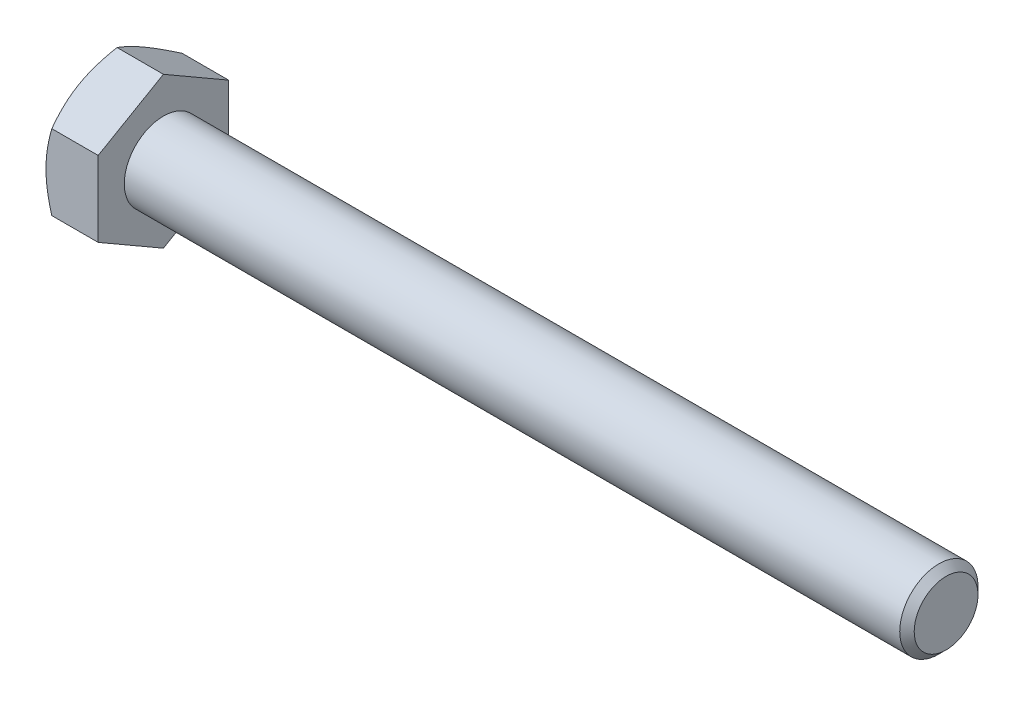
ISO-10303-21;
HEADER;
FILE_DESCRIPTION(('STEP AP214'),'2;1');
FILE_NAME('part.step','',(''),(''),'','','');
FILE_SCHEMA(('AUTOMOTIVE_DESIGN { 1 0 10303 214 1 1 1 1 }'));
ENDSEC;
DATA;
#1=APPLICATION_CONTEXT('core data for automotive mechanical design processes');
#2=APPLICATION_PROTOCOL_DEFINITION('international standard','automotive_design',2000,#1);
#3=PRODUCT_CONTEXT('',#1,'mechanical');
#4=PRODUCT('Part','Part','',(#3));
#5=PRODUCT_RELATED_PRODUCT_CATEGORY('part','',(#4));
#6=PRODUCT_DEFINITION_FORMATION('','',#4);
#7=PRODUCT_DEFINITION_CONTEXT('part definition',#1,'design');
#8=PRODUCT_DEFINITION('design','',#6,#7);
#9=PRODUCT_DEFINITION_SHAPE('','',#8);
#10=(LENGTH_UNIT() NAMED_UNIT(*) SI_UNIT(.MILLI.,.METRE.));
#11=(NAMED_UNIT(*) PLANE_ANGLE_UNIT() SI_UNIT($,.RADIAN.));
#12=(NAMED_UNIT(*) SI_UNIT($,.STERADIAN.) SOLID_ANGLE_UNIT());
#13=UNCERTAINTY_MEASURE_WITH_UNIT(LENGTH_MEASURE(1.E-05),#10,'distance_accuracy_value','');
#14=(GEOMETRIC_REPRESENTATION_CONTEXT(3) GLOBAL_UNCERTAINTY_ASSIGNED_CONTEXT((#13)) GLOBAL_UNIT_ASSIGNED_CONTEXT((#10,
#11,#12)) REPRESENTATION_CONTEXT('',''));
#15=CARTESIAN_POINT('',(0.,0.,0.));
#16=DIRECTION('',(0.,0.,1.));
#17=DIRECTION('',(1.,0.,0.));
#18=AXIS2_PLACEMENT_3D('',#15,#16,#17);
#19=CARTESIAN_POINT('',(4.,2.88675134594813,-5.));
#20=DIRECTION('',(0.,-0.866025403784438,0.500000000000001));
#21=DIRECTION('',(0.,-0.500000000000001,-0.866025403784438));
#22=AXIS2_PLACEMENT_3D('',#19,#20,#21);
#23=PLANE('',#22);
#24=CARTESIAN_POINT('',(0.446648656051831,5.7736181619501,0.0002));
#25=CARTESIAN_POINT('',(0.373386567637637,5.64675433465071,-0.219534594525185));
#26=CARTESIAN_POINT('',(0.306751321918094,5.5188054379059,-0.441148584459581));
#27=CARTESIAN_POINT('',(0.190438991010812,5.26069210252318,-0.888213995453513));
#28=CARTESIAN_POINT('',(0.14080304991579,5.13052307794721,-1.11367335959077));
#29=CARTESIAN_POINT('',(0.0635510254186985,4.87177839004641,-1.56183230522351));
#30=CARTESIAN_POINT('',(0.0354203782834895,4.74324302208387,-1.78446209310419));
#31=CARTESIAN_POINT('',(0.0101949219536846,4.54998783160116,-2.11918990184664));
#32=CARTESIAN_POINT('',(0.00461345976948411,4.48552534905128,-2.23084219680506));
#33=CARTESIAN_POINT('',(-0.000797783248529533,4.35654081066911,-2.4542499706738));
#34=CARTESIAN_POINT('',(-0.000627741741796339,4.2920187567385,-2.56600544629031));
#35=CARTESIAN_POINT('',(0.00775363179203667,4.11524635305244,-2.87218423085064));
#36=CARTESIAN_POINT('',(0.0218297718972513,4.00305457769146,-3.06650608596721));
#37=CARTESIAN_POINT('',(0.06646525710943,3.77941563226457,-3.45386010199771));
#38=CARTESIAN_POINT('',(0.0970398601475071,3.66796924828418,-3.64689090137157));
#39=CARTESIAN_POINT('',(0.173468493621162,3.44387972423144,-4.03502534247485));
#40=CARTESIAN_POINT('',(0.219646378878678,3.3312648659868,-4.23007999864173));
#41=CARTESIAN_POINT('',(0.324451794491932,3.1077146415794,-4.61728034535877));
#42=CARTESIAN_POINT('',(0.383054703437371,2.99677641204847,-4.80943099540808));
#43=CARTESIAN_POINT('',(0.446648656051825,2.88663587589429,-5.0002));
#44=B_SPLINE_CURVE_WITH_KNOTS('',3,(#24,#25,#26,#27,#28,#29,#30,#31,#32,#33,#34,#35,#36,#37,#38,
#39,#40,#41,#42,#43),.UNSPECIFIED.,.F.,.F.,(4,2,2,2,2,2,2,2,2,4),(0.,0.792555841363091,
1.58701660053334,2.36181537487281,2.74884076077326,3.13585419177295,3.80962362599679,
4.48401723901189,5.17336882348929,5.86136694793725),.UNSPECIFIED.);
#45=CARTESIAN_POINT('',(0.446581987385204,5.77350269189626,0.));
#46=VERTEX_POINT('',#45);
#47=CARTESIAN_POINT('',(0.,4.33012701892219,-2.50000000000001));
#48=VERTEX_POINT('',#47);
#49=EDGE_CURVE('E50',#46,#48,#44,.T.);
#50=ORIENTED_EDGE('',*,*,#49,.F.);
#51=DIRECTION('',(-1.,0.,0.));
#52=VECTOR('',#51,1.);
#53=CARTESIAN_POINT('',(4.,5.77350269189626,0.));
#54=LINE('',#53,#52);
#55=CARTESIAN_POINT('',(4.,5.77350269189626,0.));
#56=VERTEX_POINT('',#55);
#57=EDGE_CURVE('E146',#56,#46,#54,.T.);
#58=ORIENTED_EDGE('',*,*,#57,.F.);
#59=DIRECTION('',(0.,0.500000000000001,0.866025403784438));
#60=VECTOR('',#59,1.);
#61=CARTESIAN_POINT('',(4.,2.88675134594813,-5.));
#62=LINE('',#61,#60);
#63=CARTESIAN_POINT('',(4.,2.88675134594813,-5.));
#64=VERTEX_POINT('',#63);
#65=EDGE_CURVE('E237',#64,#56,#62,.T.);
#66=ORIENTED_EDGE('',*,*,#65,.F.);
#67=DIRECTION('',(-1.,0.,0.));
#68=VECTOR('',#67,1.);
#69=CARTESIAN_POINT('',(4.,2.88675134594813,-5.));
#70=LINE('',#69,#68);
#71=CARTESIAN_POINT('',(0.446581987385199,2.88675134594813,-5.));
#72=VERTEX_POINT('',#71);
#73=EDGE_CURVE('E134',#64,#72,#70,.T.);
#74=ORIENTED_EDGE('',*,*,#73,.T.);
#75=EDGE_CURVE('E128',#48,#72,#44,.T.);
#76=ORIENTED_EDGE('',*,*,#75,.F.);
#77=EDGE_LOOP('',(#50,#58,#66,#74,#76));
#78=FACE_BOUND('',#77,.T.);
#79=ADVANCED_FACE('F34',(#78),#23,.F.);
#80=CARTESIAN_POINT('',(4.,5.77350269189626,0.));
#81=DIRECTION('',(0.,-0.866025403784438,-0.500000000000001));
#82=DIRECTION('',(0.,0.500000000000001,-0.866025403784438));
#83=AXIS2_PLACEMENT_3D('',#80,#81,#82);
#84=PLANE('',#83);
#85=CARTESIAN_POINT('',(0.446648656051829,2.88663587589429,5.0002));
#86=CARTESIAN_POINT('',(0.373386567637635,3.01349970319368,4.78046540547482));
#87=CARTESIAN_POINT('',(0.306751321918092,3.14144859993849,4.55885141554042));
#88=CARTESIAN_POINT('',(0.190438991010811,3.39956193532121,4.11178600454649));
#89=CARTESIAN_POINT('',(0.140803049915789,3.52973095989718,3.88632664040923));
#90=CARTESIAN_POINT('',(0.0635510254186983,3.78847564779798,3.43816769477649));
#91=CARTESIAN_POINT('',(0.0354203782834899,3.91701101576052,3.21553790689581));
#92=CARTESIAN_POINT('',(0.0101949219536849,4.11026620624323,2.88081009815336));
#93=CARTESIAN_POINT('',(0.00461345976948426,4.17472868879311,2.76915780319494));
#94=CARTESIAN_POINT('',(-0.000797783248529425,4.30371322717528,2.5457500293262));
#95=CARTESIAN_POINT('',(-0.000627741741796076,4.36823528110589,2.43399455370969));
#96=CARTESIAN_POINT('',(0.0077536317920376,4.54500768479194,2.12781576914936));
#97=CARTESIAN_POINT('',(0.021829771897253,4.65719946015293,1.93349391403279));
#98=CARTESIAN_POINT('',(0.0664652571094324,4.88083840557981,1.5461398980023));
#99=CARTESIAN_POINT('',(0.0970398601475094,4.99228478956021,1.35310909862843));
#100=CARTESIAN_POINT('',(0.173468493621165,5.21637431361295,0.964974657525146));
#101=CARTESIAN_POINT('',(0.219646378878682,5.32898917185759,0.769920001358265));
#102=CARTESIAN_POINT('',(0.324451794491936,5.55253939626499,0.382719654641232));
#103=CARTESIAN_POINT('',(0.383054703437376,5.66347762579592,0.190569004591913));
#104=CARTESIAN_POINT('',(0.446648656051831,5.7736181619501,-0.000200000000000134));
#105=B_SPLINE_CURVE_WITH_KNOTS('',3,(#85,#86,#87,#88,#89,#90,#91,#92,#93,#94,#95,#96,#97,#98,
#99,#100,#101,#102,#103,#104),.UNSPECIFIED.,.F.,.F.,(4,2,2,2,2,2,2,2,2,4),(0.,0.792555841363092,
1.58701660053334,2.36181537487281,2.74884076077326,3.13585419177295,3.80962362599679,
4.4840172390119,5.17336882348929,5.86136694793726),.UNSPECIFIED.);
#106=CARTESIAN_POINT('',(0.446581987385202,2.88675134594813,5.));
#107=VERTEX_POINT('',#106);
#108=CARTESIAN_POINT('',(0.,4.33012701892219,2.5));
#109=VERTEX_POINT('',#108);
#110=EDGE_CURVE('E57',#107,#109,#105,.T.);
#111=ORIENTED_EDGE('',*,*,#110,.F.);
#112=DIRECTION('',(-1.,0.,0.));
#113=VECTOR('',#112,1.);
#114=CARTESIAN_POINT('',(4.,2.88675134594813,5.));
#115=LINE('',#114,#113);
#116=CARTESIAN_POINT('',(4.,2.88675134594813,5.));
#117=VERTEX_POINT('',#116);
#118=EDGE_CURVE('E144',#117,#107,#115,.T.);
#119=ORIENTED_EDGE('',*,*,#118,.F.);
#120=DIRECTION('',(0.,-0.500000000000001,0.866025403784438));
#121=VECTOR('',#120,1.);
#122=CARTESIAN_POINT('',(4.,5.77350269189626,0.));
#123=LINE('',#122,#121);
#124=EDGE_CURVE('E235',#56,#117,#123,.T.);
#125=ORIENTED_EDGE('',*,*,#124,.F.);
#126=ORIENTED_EDGE('',*,*,#57,.T.);
#127=EDGE_CURVE('E161',#109,#46,#105,.T.);
#128=ORIENTED_EDGE('',*,*,#127,.F.);
#129=EDGE_LOOP('',(#111,#119,#125,#126,#128));
#130=FACE_BOUND('',#129,.T.);
#131=ADVANCED_FACE('F167',(#130),#84,.F.);
#132=CARTESIAN_POINT('',(4.,2.88675134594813,5.));
#133=DIRECTION('',(0.,0.,-1.));
#134=DIRECTION('',(-1.,0.,0.));
#135=AXIS2_PLACEMENT_3D('',#132,#133,#134);
#136=PLANE('',#135);
#137=CARTESIAN_POINT('',(2.47533544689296,-7.82661640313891,5.));
#138=CARTESIAN_POINT('',(2.36879683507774,-7.60758613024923,5.));
#139=CARTESIAN_POINT('',(2.26325911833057,-7.38806071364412,5.));
#140=CARTESIAN_POINT('',(2.05474707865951,-6.94775649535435,5.));
#141=CARTESIAN_POINT('',(1.95177314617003,-6.7269775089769,5.));
#142=CARTESIAN_POINT('',(1.74844778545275,-6.28280027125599,5.));
#143=CARTESIAN_POINT('',(1.64811306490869,-6.05939434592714,5.));
#144=CARTESIAN_POINT('',(1.45145486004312,-5.61083043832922,5.));
#145=CARTESIAN_POINT('',(1.35513119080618,-5.38567253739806,5.));
#146=CARTESIAN_POINT('',(1.16445037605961,-4.92576614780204,5.));
#147=CARTESIAN_POINT('',(1.07026351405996,-4.69094667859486,5.));
#148=CARTESIAN_POINT('',(0.888844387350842,-4.21858752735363,5.));
#149=CARTESIAN_POINT('',(0.801612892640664,-3.98104754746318,5.));
#150=CARTESIAN_POINT('',(0.636341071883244,-3.50329086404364,5.));
#151=CARTESIAN_POINT('',(0.558282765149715,-3.26308044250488,5.));
#152=CARTESIAN_POINT('',(0.413813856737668,-2.77921467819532,5.));
#153=CARTESIAN_POINT('',(0.347399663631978,-2.53556042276,5.));
#154=CARTESIAN_POINT('',(0.229707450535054,-2.04600448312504,5.));
#155=CARTESIAN_POINT('',(0.178346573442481,-1.80012308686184,5.));
#156=CARTESIAN_POINT('',(0.0936230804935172,-1.30522837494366,5.));
#157=CARTESIAN_POINT('',(0.0602585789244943,-1.05621539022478,5.));
#158=CARTESIAN_POINT('',(0.0146229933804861,-0.559584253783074,5.));
#159=CARTESIAN_POINT('',(0.00207498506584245,-0.311992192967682,5.));
#160=CARTESIAN_POINT('',(-0.00159747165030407,0.183375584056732,5.));
#161=CARTESIAN_POINT('',(0.00727849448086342,0.431151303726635,5.));
#162=CARTESIAN_POINT('',(0.039726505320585,0.849622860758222,5.));
#163=CARTESIAN_POINT('',(0.0579847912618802,1.02075746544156,5.));
#164=CARTESIAN_POINT('',(0.103624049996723,1.36181398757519,5.));
#165=CARTESIAN_POINT('',(0.131006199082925,1.5317357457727,5.));
#166=CARTESIAN_POINT('',(0.225403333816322,2.03942834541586,5.));
#167=CARTESIAN_POINT('',(0.304653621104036,2.37495177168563,5.));
#168=CARTESIAN_POINT('',(0.442611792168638,2.87686006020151,5.));
#169=CARTESIAN_POINT('',(0.492453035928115,3.04583048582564,5.));
#170=CARTESIAN_POINT('',(0.597441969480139,3.38213061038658,5.));
#171=CARTESIAN_POINT('',(0.652589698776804,3.54946029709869,5.));
#172=CARTESIAN_POINT('',(0.767295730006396,3.88253122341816,5.));
#173=CARTESIAN_POINT('',(0.826852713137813,4.04827292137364,5.));
#174=CARTESIAN_POINT('',(0.94966349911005,4.37837269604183,5.));
#175=CARTESIAN_POINT('',(1.01291722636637,4.54273080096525,5.));
#176=CARTESIAN_POINT('',(1.18384085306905,4.97467594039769,5.));
#177=CARTESIAN_POINT('',(1.29410564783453,5.24123504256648,5.));
#178=CARTESIAN_POINT('',(1.52085041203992,5.77170603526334,5.));
#179=CARTESIAN_POINT('',(1.63733099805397,6.03561766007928,5.));
#180=CARTESIAN_POINT('',(1.87507624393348,6.56138078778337,5.));
#181=CARTESIAN_POINT('',(1.99634255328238,6.82323154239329,5.));
#182=CARTESIAN_POINT('',(2.24254703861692,7.34518395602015,5.));
#183=CARTESIAN_POINT('',(2.36748508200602,7.60528567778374,5.));
#184=CARTESIAN_POINT('',(2.62044102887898,8.12446478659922,5.));
#185=CARTESIAN_POINT('',(2.74846325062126,8.38354006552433,5.));
#186=CARTESIAN_POINT('',(3.00682668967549,8.90053291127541,5.));
#187=CARTESIAN_POINT('',(3.13716793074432,9.1584504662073,5.));
#188=CARTESIAN_POINT('',(3.53092424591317,9.9306766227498,5.));
#189=CARTESIAN_POINT('',(3.79712405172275,10.4435647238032,5.));
#190=CARTESIAN_POINT('',(4.30724046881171,11.4147548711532,5.));
#191=CARTESIAN_POINT('',(4.55067498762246,11.873311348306,5.));
#192=CARTESIAN_POINT('',(5.04052915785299,12.7888590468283,5.));
#193=CARTESIAN_POINT('',(5.28694897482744,13.2458501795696,5.));
#194=CARTESIAN_POINT('',(5.78122505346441,14.1571829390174,5.));
#195=CARTESIAN_POINT('',(6.02907430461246,14.6115283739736,5.));
#196=CARTESIAN_POINT('',(6.52648185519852,15.5192398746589,5.));
#197=CARTESIAN_POINT('',(6.77604002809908,15.9726060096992,5.));
#198=CARTESIAN_POINT('',(7.02622264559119,16.4256251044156,5.));
#199=B_SPLINE_CURVE_WITH_KNOTS('',3,(#137,#138,#139,#140,#141,#142,#143,#144,#145,#146,#147,
#148,#149,#150,#151,#152,#153,#154,#155,#156,#157,#158,#159,#160,#161,#162,#163,#164,#165,#166,
#167,#168,#169,#170,#171,#172,#173,#174,#175,#176,#177,#178,#179,#180,#181,#182,#183,#184,#185,
#186,#187,#188,#189,#190,#191,#192,#193,#194,#195,#196,#197,#198),.UNSPECIFIED.,.F.,.F.,(4,2,2,
2,2,2,2,2,2,2,2,2,2,2,2,2,2,2,2,2,2,2,2,2,2,2,2,2,2,2,4),(0.,0.7307086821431,1.46152797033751,
2.19620403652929,2.93084619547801,3.68977491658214,4.44878753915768,5.20628666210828,
5.96355173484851,6.71656679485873,7.46950293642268,8.21233991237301,8.95519126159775,
9.4712599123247,9.98739512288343,11.0201893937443,11.5486465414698,12.0771076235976,
12.6054112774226,13.1337041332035,13.9989833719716,14.8643486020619,15.7300147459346,
16.5956496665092,17.4625765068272,18.3295122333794,20.0630293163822,21.6205191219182,
23.1780956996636,24.7307447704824,26.2832800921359),.UNSPECIFIED.);
#200=CARTESIAN_POINT('',(0.446581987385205,-2.88675134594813,5.));
#201=VERTEX_POINT('',#200);
#202=CARTESIAN_POINT('',(0.,0.,5.));
#203=VERTEX_POINT('',#202);
#204=EDGE_CURVE('E247',#201,#203,#199,.T.);
#205=ORIENTED_EDGE('',*,*,#204,.F.);
#206=DIRECTION('',(-1.,0.,0.));
#207=VECTOR('',#206,1.);
#208=CARTESIAN_POINT('',(4.,-2.88675134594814,5.));
#209=LINE('',#208,#207);
#210=CARTESIAN_POINT('',(4.,-2.88675134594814,5.));
#211=VERTEX_POINT('',#210);
#212=EDGE_CURVE('E136',#211,#201,#209,.T.);
#213=ORIENTED_EDGE('',*,*,#212,.F.);
#214=DIRECTION('',(0.,-1.,0.));
#215=VECTOR('',#214,1.);
#216=CARTESIAN_POINT('',(4.,2.88675134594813,5.));
#217=LINE('',#216,#215);
#218=EDGE_CURVE('E231',#117,#211,#217,.T.);
#219=ORIENTED_EDGE('',*,*,#218,.F.);
#220=ORIENTED_EDGE('',*,*,#118,.T.);
#221=EDGE_CURVE('E185',#203,#107,#199,.T.);
#222=ORIENTED_EDGE('',*,*,#221,.F.);
#223=EDGE_LOOP('',(#205,#213,#219,#220,#222));
#224=FACE_BOUND('',#223,.T.);
#225=ADVANCED_FACE('F253',(#224),#136,.F.);
#226=CARTESIAN_POINT('',(4.,-5.77350269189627,0.));
#227=DIRECTION('',(0.,0.866025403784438,-0.500000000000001));
#228=DIRECTION('',(0.,0.500000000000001,0.866025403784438));
#229=AXIS2_PLACEMENT_3D('',#226,#227,#228);
#230=PLANE('',#229);
#231=CARTESIAN_POINT('',(0.446648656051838,-5.77361816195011,-0.000199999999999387));
#232=CARTESIAN_POINT('',(0.373386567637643,-5.64675433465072,0.219534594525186));
#233=CARTESIAN_POINT('',(0.3067513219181,-5.51880543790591,0.441148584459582));
#234=CARTESIAN_POINT('',(0.190438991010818,-5.26069210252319,0.888213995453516));
#235=CARTESIAN_POINT('',(0.140803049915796,-5.13052307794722,1.11367335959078));
#236=CARTESIAN_POINT('',(0.0635510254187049,-4.87177839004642,1.56183230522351));
#237=CARTESIAN_POINT('',(0.0354203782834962,-4.74324302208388,1.7844620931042));
#238=CARTESIAN_POINT('',(0.0101949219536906,-4.54998783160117,2.11918990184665));
#239=CARTESIAN_POINT('',(0.00461345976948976,-4.48552534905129,2.23084219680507));
#240=CARTESIAN_POINT('',(-0.000797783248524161,-4.35654081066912,2.4542499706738));
#241=CARTESIAN_POINT('',(-0.000627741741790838,-4.29201875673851,2.56600544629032));
#242=CARTESIAN_POINT('',(0.00775363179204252,-4.11524635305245,2.87218423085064));
#243=CARTESIAN_POINT('',(0.0218297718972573,-4.00305457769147,3.06650608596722));
#244=CARTESIAN_POINT('',(0.0664652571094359,-3.77941563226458,3.45386010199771));
#245=CARTESIAN_POINT('',(0.0970398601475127,-3.66796924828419,3.64689090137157));
#246=CARTESIAN_POINT('',(0.173468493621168,-3.44387972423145,4.03502534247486));
#247=CARTESIAN_POINT('',(0.219646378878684,-3.33126486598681,4.23007999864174));
#248=CARTESIAN_POINT('',(0.324451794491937,-3.10771464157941,4.61728034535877));
#249=CARTESIAN_POINT('',(0.383054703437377,-2.99677641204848,4.80943099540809));
#250=CARTESIAN_POINT('',(0.446648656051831,-2.8866358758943,5.0002));
#251=B_SPLINE_CURVE_WITH_KNOTS('',3,(#231,#232,#233,#234,#235,#236,#237,#238,#239,#240,#241,
#242,#243,#244,#245,#246,#247,#248,#249,#250),.UNSPECIFIED.,.F.,.F.,(4,2,2,2,2,2,2,2,2,4),(0.,
0.792555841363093,1.58701660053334,2.36181537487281,2.74884076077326,3.13585419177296,
3.8096236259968,4.4840172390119,5.17336882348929,5.86136694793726),.UNSPECIFIED.);
#252=CARTESIAN_POINT('',(0.446581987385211,-5.77350269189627,0.));
#253=VERTEX_POINT('',#252);
#254=CARTESIAN_POINT('',(0.,-4.33012701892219,2.50000000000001));
#255=VERTEX_POINT('',#254);
#256=EDGE_CURVE('E169',#253,#255,#251,.T.);
#257=ORIENTED_EDGE('',*,*,#256,.F.);
#258=DIRECTION('',(-1.,0.,0.));
#259=VECTOR('',#258,1.);
#260=CARTESIAN_POINT('',(4.,-5.77350269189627,0.));
#261=LINE('',#260,#259);
#262=CARTESIAN_POINT('',(4.,-5.77350269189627,0.));
#263=VERTEX_POINT('',#262);
#264=EDGE_CURVE('E133',#263,#253,#261,.T.);
#265=ORIENTED_EDGE('',*,*,#264,.F.);
#266=DIRECTION('',(0.,-0.500000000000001,-0.866025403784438));
#267=VECTOR('',#266,1.);
#268=CARTESIAN_POINT('',(4.,-5.77350269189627,0.));
#269=LINE('',#268,#267);
#270=EDGE_CURVE('E229',#211,#263,#269,.T.);
#271=ORIENTED_EDGE('',*,*,#270,.F.);
#272=ORIENTED_EDGE('',*,*,#212,.T.);
#273=EDGE_CURVE('E171',#255,#201,#251,.T.);
#274=ORIENTED_EDGE('',*,*,#273,.F.);
#275=EDGE_LOOP('',(#257,#265,#271,#272,#274));
#276=FACE_BOUND('',#275,.T.);
#277=ADVANCED_FACE('F225',(#276),#230,.F.);
#278=CARTESIAN_POINT('',(4.,-2.88675134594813,-5.));
#279=DIRECTION('',(0.,0.866025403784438,0.500000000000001));
#280=DIRECTION('',(0.,-0.500000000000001,0.866025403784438));
#281=AXIS2_PLACEMENT_3D('',#278,#279,#280);
#282=PLANE('',#281);
#283=CARTESIAN_POINT('',(0.446648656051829,-2.8866358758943,-5.0002));
#284=CARTESIAN_POINT('',(0.373386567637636,-3.01349970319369,-4.78046540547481));
#285=CARTESIAN_POINT('',(0.306751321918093,-3.1414485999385,-4.55885141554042));
#286=CARTESIAN_POINT('',(0.190438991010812,-3.39956193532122,-4.11178600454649));
#287=CARTESIAN_POINT('',(0.140803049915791,-3.52973095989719,-3.88632664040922));
#288=CARTESIAN_POINT('',(0.0635510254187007,-3.78847564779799,-3.43816769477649));
#289=CARTESIAN_POINT('',(0.0354203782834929,-3.91701101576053,-3.21553790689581));
#290=CARTESIAN_POINT('',(0.0101949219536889,-4.11026620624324,-2.88081009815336));
#291=CARTESIAN_POINT('',(0.00461345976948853,-4.17472868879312,-2.76915780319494));
#292=CARTESIAN_POINT('',(-0.000797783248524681,-4.30371322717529,-2.5457500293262));
#293=CARTESIAN_POINT('',(-0.000627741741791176,-4.3682352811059,-2.43399455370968));
#294=CARTESIAN_POINT('',(0.00775363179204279,-4.54500768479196,-2.12781576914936));
#295=CARTESIAN_POINT('',(0.0218297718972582,-4.65719946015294,-1.93349391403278));
#296=CARTESIAN_POINT('',(0.066465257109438,-4.88083840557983,-1.54613989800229));
#297=CARTESIAN_POINT('',(0.0970398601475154,-4.99228478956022,-1.35310909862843));
#298=CARTESIAN_POINT('',(0.173468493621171,-5.21637431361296,-0.964974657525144));
#299=CARTESIAN_POINT('',(0.219646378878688,-5.3289891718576,-0.769920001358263));
#300=CARTESIAN_POINT('',(0.324451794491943,-5.552539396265,-0.382719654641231));
#301=CARTESIAN_POINT('',(0.383054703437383,-5.66347762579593,-0.190569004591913));
#302=CARTESIAN_POINT('',(0.446648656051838,-5.77361816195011,0.000200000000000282));
#303=B_SPLINE_CURVE_WITH_KNOTS('',3,(#283,#284,#285,#286,#287,#288,#289,#290,#291,#292,#293,
#294,#295,#296,#297,#298,#299,#300,#301,#302),.UNSPECIFIED.,.F.,.F.,(4,2,2,2,2,2,2,2,2,4),(0.,
0.792555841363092,1.58701660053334,2.36181537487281,2.74884076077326,3.13585419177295,
3.8096236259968,4.4840172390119,5.17336882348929,5.86136694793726),.UNSPECIFIED.);
#304=CARTESIAN_POINT('',(0.446581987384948,-2.88675134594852,-5.));
#305=VERTEX_POINT('',#304);
#306=CARTESIAN_POINT('',(0.,-4.33012701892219,-2.50000000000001));
#307=VERTEX_POINT('',#306);
#308=EDGE_CURVE('E110',#305,#307,#303,.T.);
#309=ORIENTED_EDGE('',*,*,#308,.F.);
#310=DIRECTION('',(-1.,0.,0.));
#311=VECTOR('',#310,1.);
#312=CARTESIAN_POINT('',(4.,-2.88675134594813,-5.));
#313=LINE('',#312,#311);
#314=CARTESIAN_POINT('',(4.,-2.88675134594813,-5.));
#315=VERTEX_POINT('',#314);
#316=EDGE_CURVE('E124',#315,#305,#313,.T.);
#317=ORIENTED_EDGE('',*,*,#316,.F.);
#318=DIRECTION('',(0.,0.500000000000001,-0.866025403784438));
#319=VECTOR('',#318,1.);
#320=CARTESIAN_POINT('',(4.,-2.88675134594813,-5.));
#321=LINE('',#320,#319);
#322=EDGE_CURVE('E227',#263,#315,#321,.T.);
#323=ORIENTED_EDGE('',*,*,#322,.F.);
#324=ORIENTED_EDGE('',*,*,#264,.T.);
#325=EDGE_CURVE('E127',#307,#253,#303,.T.);
#326=ORIENTED_EDGE('',*,*,#325,.F.);
#327=EDGE_LOOP('',(#309,#317,#323,#324,#326));
#328=FACE_BOUND('',#327,.T.);
#329=ADVANCED_FACE('F122',(#328),#282,.F.);
#330=CARTESIAN_POINT('',(4.,2.88675134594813,-5.));
#331=DIRECTION('',(0.,0.,1.));
#332=DIRECTION('',(0.,-1.,0.));
#333=AXIS2_PLACEMENT_3D('',#330,#331,#332);
#334=PLANE('',#333);
#335=CARTESIAN_POINT('',(2.47533544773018,-7.82661640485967,-5.));
#336=CARTESIAN_POINT('',(2.36879683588,-7.60758613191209,-5.));
#337=CARTESIAN_POINT('',(2.2632591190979,-7.38806071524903,-5.));
#338=CARTESIAN_POINT('',(2.05474707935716,-6.9477564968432,-5.));
#339=CARTESIAN_POINT('',(1.95177314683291,-6.72697751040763,-5.));
#340=CARTESIAN_POINT('',(1.74844778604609,-6.28280027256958,-5.));
#341=CARTESIAN_POINT('',(1.64811306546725,-6.05939434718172,-5.));
#342=CARTESIAN_POINT('',(1.4514548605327,-5.61083043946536,-5.));
#343=CARTESIAN_POINT('',(1.35513119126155,-5.38567253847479,-5.));
#344=CARTESIAN_POINT('',(1.16445037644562,-4.92576614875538,-5.));
#345=CARTESIAN_POINT('',(1.07026351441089,-4.69094667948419,-5.));
#346=CARTESIAN_POINT('',(0.888844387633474,-4.21858752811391,-5.));
#347=CARTESIAN_POINT('',(0.801612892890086,-3.98104754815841,-5.));
#348=CARTESIAN_POINT('',(0.636341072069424,-3.50329086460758,-5.));
#349=CARTESIAN_POINT('',(0.558282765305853,-3.26308044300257,-5.));
#350=CARTESIAN_POINT('',(0.413813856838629,-2.77921467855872,-5.));
#351=CARTESIAN_POINT('',(0.347399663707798,-2.53556042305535,-5.));
#352=CARTESIAN_POINT('',(0.229707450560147,-2.04600448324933,-5.));
#353=CARTESIAN_POINT('',(0.178346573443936,-1.80012308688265,-5.));
#354=CARTESIAN_POINT('',(0.093623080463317,-1.305228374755,-5.));
#355=CARTESIAN_POINT('',(0.0602585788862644,-1.05621538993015,-5.));
#356=CARTESIAN_POINT('',(0.0146229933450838,-0.559584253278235,-5.));
#357=CARTESIAN_POINT('',(0.00207498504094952,-0.311992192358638,-5.));
#358=CARTESIAN_POINT('',(-0.00159747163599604,0.183375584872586,-5.));
#359=CARTESIAN_POINT('',(0.00727849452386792,0.431151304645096,-5.));
#360=CARTESIAN_POINT('',(0.0397265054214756,0.849622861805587,-5.));
#361=CARTESIAN_POINT('',(0.057984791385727,1.02075746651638,-5.));
#362=CARTESIAN_POINT('',(0.103624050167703,1.3618139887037,-5.));
#363=CARTESIAN_POINT('',(0.131006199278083,1.53173574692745,-5.));
#364=CARTESIAN_POINT('',(0.225403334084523,2.03942834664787,-5.));
#365=CARTESIAN_POINT('',(0.304653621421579,2.37495177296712,-5.));
#366=CARTESIAN_POINT('',(0.442611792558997,2.87686006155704,-5.));
#367=CARTESIAN_POINT('',(0.492453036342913,3.04583048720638,-5.));
#368=CARTESIAN_POINT('',(0.597441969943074,3.38213061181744,-5.));
#369=CARTESIAN_POINT('',(0.652589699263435,3.54946029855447,-5.));
#370=CARTESIAN_POINT('',(0.767295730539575,3.88253122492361,-5.));
#371=CARTESIAN_POINT('',(0.826852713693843,4.04827292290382,-5.));
#372=CARTESIAN_POINT('',(0.949663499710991,4.37837269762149,-5.));
#373=CARTESIAN_POINT('',(1.01291722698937,4.54273080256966,-5.));
#374=CARTESIAN_POINT('',(1.18384085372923,4.97467594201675,-5.));
#375=CARTESIAN_POINT('',(1.29410564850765,5.24123504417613,-5.));
#376=CARTESIAN_POINT('',(1.5208504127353,5.77170603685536,-5.));
#377=CARTESIAN_POINT('',(1.63733099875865,6.03561766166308,-5.));
#378=CARTESIAN_POINT('',(1.87507624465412,6.56138078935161,-5.));
#379=CARTESIAN_POINT('',(1.99634255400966,6.82323154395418,-5.));
#380=CARTESIAN_POINT('',(2.24254703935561,7.34518395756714,-5.));
#381=CARTESIAN_POINT('',(2.36748508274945,7.60528567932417,-5.));
#382=CARTESIAN_POINT('',(2.62044102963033,8.12446478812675,-5.));
#383=CARTESIAN_POINT('',(2.74846325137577,8.38354006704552,-5.));
#384=CARTESIAN_POINT('',(3.00682669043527,8.9005329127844,-5.));
#385=CARTESIAN_POINT('',(3.1371679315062,9.15845046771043,-5.));
#386=CARTESIAN_POINT('',(3.53092424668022,9.93067662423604,-5.));
#387=CARTESIAN_POINT('',(3.79712405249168,10.443564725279,-4.99999999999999));
#388=CARTESIAN_POINT('',(4.30724046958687,11.4147548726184,-4.99999999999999));
#389=CARTESIAN_POINT('',(4.55067498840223,11.8733113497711,-4.99999999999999));
#390=CARTESIAN_POINT('',(5.04052915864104,12.7888590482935,-4.99999999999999));
#391=CARTESIAN_POINT('',(5.28694897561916,13.2458501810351,-4.99999999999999));
#392=CARTESIAN_POINT('',(5.78122505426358,14.1571829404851,-4.99999999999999));
#393=CARTESIAN_POINT('',(6.02907430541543,14.6115283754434,-4.99999999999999));
#394=CARTESIAN_POINT('',(6.52648185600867,15.519239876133,-4.99999999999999));
#395=CARTESIAN_POINT('',(6.7760400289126,15.9726060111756,-4.99999999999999));
#396=CARTESIAN_POINT('',(7.02622264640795,16.4256251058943,-4.99999999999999));
#397=B_SPLINE_CURVE_WITH_KNOTS('',3,(#335,#336,#337,#338,#339,#340,#341,#342,#343,#344,#345,
#346,#347,#348,#349,#350,#351,#352,#353,#354,#355,#356,#357,#358,#359,#360,#361,#362,#363,#364,
#365,#366,#367,#368,#369,#370,#371,#372,#373,#374,#375,#376,#377,#378,#379,#380,#381,#382,#383,
#384,#385,#386,#387,#388,#389,#390,#391,#392,#393,#394,#395,#396),.UNSPECIFIED.,.F.,.F.,(4,2,2,
2,2,2,2,2,2,2,2,2,2,2,2,2,2,2,2,2,2,2,2,2,2,2,2,2,2,2,4),(0.,0.730708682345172,1.46152797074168,
2.19620403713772,2.93084619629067,3.6897749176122,4.44878754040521,5.20628666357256,
5.96355173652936,6.7165667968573,7.46950293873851,8.21233991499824,8.95519126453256,
9.47125991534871,9.98739512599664,11.0201893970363,11.5486465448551,12.0771076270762,
12.6054112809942,13.1337041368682,13.9989833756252,14.8643486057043,15.7300147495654,
16.5956496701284,17.4625765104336,18.329512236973,20.0630293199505,21.6205191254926,
23.1780957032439,24.7307447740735,26.2832800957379),.UNSPECIFIED.);
#398=CARTESIAN_POINT('',(0.,0.,-5.));
#399=VERTEX_POINT('',#398);
#400=EDGE_CURVE('E116',#72,#399,#397,.F.);
#401=ORIENTED_EDGE('',*,*,#400,.F.);
#402=ORIENTED_EDGE('',*,*,#73,.F.);
#403=DIRECTION('',(0.,1.,0.));
#404=VECTOR('',#403,1.);
#405=CARTESIAN_POINT('',(4.,2.88675134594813,-5.));
#406=LINE('',#405,#404);
#407=EDGE_CURVE('E132',#315,#64,#406,.T.);
#408=ORIENTED_EDGE('',*,*,#407,.F.);
#409=ORIENTED_EDGE('',*,*,#316,.T.);
#410=EDGE_CURVE('E107',#399,#305,#397,.F.);
#411=ORIENTED_EDGE('',*,*,#410,.F.);
#412=EDGE_LOOP('',(#401,#402,#408,#409,#411));
#413=FACE_BOUND('',#412,.T.);
#414=ADVANCED_FACE('F130',(#413),#334,.F.);
#415=CARTESIAN_POINT('',(4.,0.,-9.99999999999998));
#416=DIRECTION('',(1.,0.,0.));
#417=DIRECTION('',(0.,0.,-1.));
#418=AXIS2_PLACEMENT_3D('',#415,#416,#417);
#419=PLANE('',#418);
#420=CARTESIAN_POINT('',(4.,0.,0.));
#421=DIRECTION('',(1.,0.,0.));
#422=DIRECTION('',(0.,0.,-1.));
#423=AXIS2_PLACEMENT_3D('',#420,#421,#422);
#424=CIRCLE('',#423,3.);
#425=CARTESIAN_POINT('',(4.,0.,-3.));
#426=VERTEX_POINT('',#425);
#427=EDGE_CURVE('E240',#426,#426,#424,.F.);
#428=ORIENTED_EDGE('',*,*,#427,.T.);
#429=EDGE_LOOP('',(#428));
#430=FACE_BOUND('',#429,.T.);
#431=ORIENTED_EDGE('',*,*,#65,.T.);
#432=ORIENTED_EDGE('',*,*,#124,.T.);
#433=ORIENTED_EDGE('',*,*,#218,.T.);
#434=ORIENTED_EDGE('',*,*,#270,.T.);
#435=ORIENTED_EDGE('',*,*,#322,.T.);
#436=ORIENTED_EDGE('',*,*,#407,.T.);
#437=EDGE_LOOP('',(#431,#432,#433,#434,#435,#436));
#438=FACE_BOUND('',#437,.T.);
#439=ADVANCED_FACE('F255',(#430,#438),#419,.T.);
#440=CARTESIAN_POINT('',(0.,0.,0.));
#441=DIRECTION('',(-1.,0.,0.));
#442=DIRECTION('',(0.,0.,1.));
#443=AXIS2_PLACEMENT_3D('',#440,#441,#442);
#444=CYLINDRICAL_SURFACE('',#443,3.);
#445=ORIENTED_EDGE('',*,*,#427,.F.);
#446=EDGE_LOOP('',(#445));
#447=FACE_BOUND('',#446,.T.);
#448=CARTESIAN_POINT('',(63.4455,0.,0.));
#449=DIRECTION('',(-1.,0.,0.));
#450=DIRECTION('',(0.,0.,1.));
#451=AXIS2_PLACEMENT_3D('',#448,#449,#450);
#452=CIRCLE('',#451,3.);
#453=CARTESIAN_POINT('',(63.4455,0.,3.));
#454=VERTEX_POINT('',#453);
#455=EDGE_CURVE('E243',#454,#454,#452,.T.);
#456=ORIENTED_EDGE('',*,*,#455,.T.);
#457=EDGE_LOOP('',(#456));
#458=FACE_BOUND('',#457,.T.);
#459=ADVANCED_FACE('F286',(#447,#458),#444,.T.);
#460=CARTESIAN_POINT('',(64.,0.,0.));
#461=DIRECTION('',(-1.,0.,0.));
#462=DIRECTION('',(0.,0.,1.));
#463=AXIS2_PLACEMENT_3D('',#460,#461,#462);
#464=CONICAL_SURFACE('',#463,2.4455,0.785398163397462);
#465=ORIENTED_EDGE('',*,*,#455,.F.);
#466=EDGE_LOOP('',(#465));
#467=FACE_BOUND('',#466,.T.);
#468=CARTESIAN_POINT('',(64.,0.,0.));
#469=DIRECTION('',(-1.,0.,0.));
#470=DIRECTION('',(0.,0.,1.));
#471=AXIS2_PLACEMENT_3D('',#468,#469,#470);
#472=CIRCLE('',#471,2.4455);
#473=CARTESIAN_POINT('',(64.,0.,2.4455));
#474=VERTEX_POINT('',#473);
#475=EDGE_CURVE('E245',#474,#474,#472,.T.);
#476=ORIENTED_EDGE('',*,*,#475,.T.);
#477=EDGE_LOOP('',(#476));
#478=FACE_BOUND('',#477,.T.);
#479=ADVANCED_FACE('F289',(#467,#478),#464,.T.);
#480=CARTESIAN_POINT('',(64.,0.,0.));
#481=DIRECTION('',(-1.,0.,0.));
#482=DIRECTION('',(0.,0.,1.));
#483=AXIS2_PLACEMENT_3D('',#480,#481,#482);
#484=PLANE('',#483);
#485=ORIENTED_EDGE('',*,*,#475,.F.);
#486=EDGE_LOOP('',(#485));
#487=FACE_BOUND('',#486,.T.);
#488=ADVANCED_FACE('F199',(#487),#484,.F.);
#489=CARTESIAN_POINT('',(0.,0.,0.));
#490=DIRECTION('',(1.,0.,0.));
#491=DIRECTION('',(0.,0.,-1.));
#492=AXIS2_PLACEMENT_3D('',#489,#490,#491);
#493=CONICAL_SURFACE('',#492,5.,1.0471975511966);
#494=ORIENTED_EDGE('',*,*,#308,.T.);
#495=CARTESIAN_POINT('',(0.,0.,0.));
#496=DIRECTION('',(1.,0.,0.));
#497=DIRECTION('',(0.,0.,-1.));
#498=AXIS2_PLACEMENT_3D('',#495,#496,#497);
#499=CIRCLE('',#498,5.);
#500=EDGE_CURVE('E38',#307,#399,#499,.T.);
#501=ORIENTED_EDGE('',*,*,#500,.T.);
#502=ORIENTED_EDGE('',*,*,#410,.T.);
#503=EDGE_LOOP('',(#494,#501,#502));
#504=FACE_BOUND('',#503,.T.);
#505=ADVANCED_FACE('F109',(#504),#493,.T.);
#506=ORIENTED_EDGE('',*,*,#256,.T.);
#507=EDGE_CURVE('E151',#255,#307,#499,.T.);
#508=ORIENTED_EDGE('',*,*,#507,.T.);
#509=ORIENTED_EDGE('',*,*,#325,.T.);
#510=EDGE_LOOP('',(#506,#508,#509));
#511=FACE_BOUND('',#510,.T.);
#512=ADVANCED_FACE('F198',(#511),#493,.T.);
#513=ORIENTED_EDGE('',*,*,#204,.T.);
#514=EDGE_CURVE('E152',#203,#255,#499,.T.);
#515=ORIENTED_EDGE('',*,*,#514,.T.);
#516=ORIENTED_EDGE('',*,*,#273,.T.);
#517=EDGE_LOOP('',(#513,#515,#516));
#518=FACE_BOUND('',#517,.T.);
#519=ADVANCED_FACE('F193',(#518),#493,.T.);
#520=ORIENTED_EDGE('',*,*,#221,.T.);
#521=ORIENTED_EDGE('',*,*,#110,.T.);
#522=CARTESIAN_POINT('',(0.,0.,0.));
#523=DIRECTION('',(-1.,0.,0.));
#524=DIRECTION('',(0.,0.,1.));
#525=AXIS2_PLACEMENT_3D('',#522,#523,#524);
#526=CIRCLE('',#525,5.);
#527=EDGE_CURVE('E117',#203,#109,#526,.T.);
#528=ORIENTED_EDGE('',*,*,#527,.F.);
#529=EDGE_LOOP('',(#520,#521,#528));
#530=FACE_BOUND('',#529,.T.);
#531=ADVANCED_FACE('F197',(#530),#493,.T.);
#532=ORIENTED_EDGE('',*,*,#127,.T.);
#533=ORIENTED_EDGE('',*,*,#49,.T.);
#534=EDGE_CURVE('E43',#48,#109,#499,.T.);
#535=ORIENTED_EDGE('',*,*,#534,.T.);
#536=EDGE_LOOP('',(#532,#533,#535));
#537=FACE_BOUND('',#536,.T.);
#538=ADVANCED_FACE('F160',(#537),#493,.T.);
#539=ORIENTED_EDGE('',*,*,#75,.T.);
#540=ORIENTED_EDGE('',*,*,#400,.T.);
#541=EDGE_CURVE('E11',#399,#48,#499,.T.);
#542=ORIENTED_EDGE('',*,*,#541,.T.);
#543=EDGE_LOOP('',(#539,#540,#542));
#544=FACE_BOUND('',#543,.T.);
#545=ADVANCED_FACE('F258',(#544),#493,.T.);
#546=CARTESIAN_POINT('',(0.,0.,-9.99999999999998));
#547=DIRECTION('',(1.,0.,0.));
#548=DIRECTION('',(0.,0.,-1.));
#549=AXIS2_PLACEMENT_3D('',#546,#547,#548);
#550=PLANE('',#549);
#551=ORIENTED_EDGE('',*,*,#541,.F.);
#552=ORIENTED_EDGE('',*,*,#500,.F.);
#553=ORIENTED_EDGE('',*,*,#507,.F.);
#554=ORIENTED_EDGE('',*,*,#514,.F.);
#555=ORIENTED_EDGE('',*,*,#527,.T.);
#556=ORIENTED_EDGE('',*,*,#534,.F.);
#557=EDGE_LOOP('',(#551,#552,#553,#554,#555,#556));
#558=FACE_BOUND('',#557,.T.);
#559=ADVANCED_FACE('F164',(#558),#550,.F.);
#560=CLOSED_SHELL('',(#79,#131,#225,#277,#329,#414,#439,#459,#479,#488,#505,#512,#519,#531,#538,
#545,#559));
#561=MANIFOLD_SOLID_BREP('B2',#560);
#562=ADVANCED_BREP_SHAPE_REPRESENTATION('',(#18,#561),#14);
#563=SHAPE_DEFINITION_REPRESENTATION(#9,#562);
ENDSEC;
END-ISO-10303-21;
